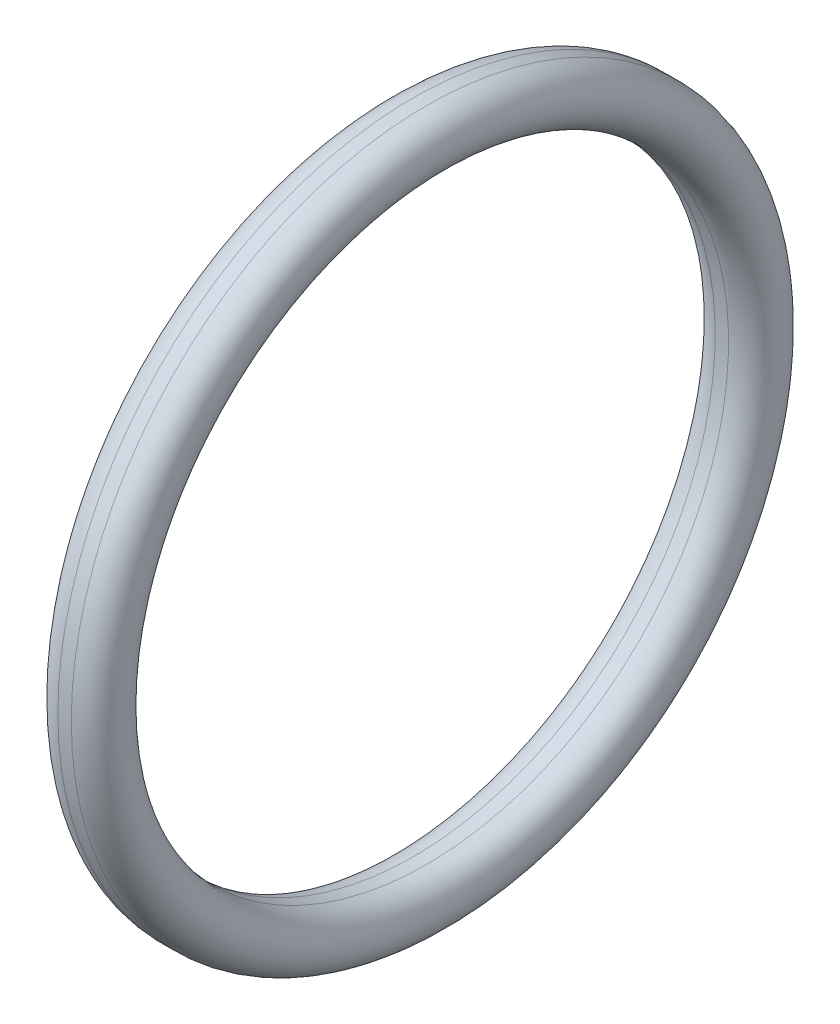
ISO-10303-21;
HEADER;
FILE_DESCRIPTION(('STEP AP214'),'2;1');
FILE_NAME('part.step','',(''),(''),'','','');
FILE_SCHEMA(('AUTOMOTIVE_DESIGN { 1 0 10303 214 1 1 1 1 }'));
ENDSEC;
DATA;
#1=APPLICATION_CONTEXT('core data for automotive mechanical design processes');
#2=APPLICATION_PROTOCOL_DEFINITION('international standard','automotive_design',2000,#1);
#3=PRODUCT_CONTEXT('',#1,'mechanical');
#4=PRODUCT('Part','Part','',(#3));
#5=PRODUCT_RELATED_PRODUCT_CATEGORY('part','',(#4));
#6=PRODUCT_DEFINITION_FORMATION('','',#4);
#7=PRODUCT_DEFINITION_CONTEXT('part definition',#1,'design');
#8=PRODUCT_DEFINITION('design','',#6,#7);
#9=PRODUCT_DEFINITION_SHAPE('','',#8);
#10=(LENGTH_UNIT() NAMED_UNIT(*) SI_UNIT(.MILLI.,.METRE.));
#11=(NAMED_UNIT(*) PLANE_ANGLE_UNIT() SI_UNIT($,.RADIAN.));
#12=(NAMED_UNIT(*) SI_UNIT($,.STERADIAN.) SOLID_ANGLE_UNIT());
#13=UNCERTAINTY_MEASURE_WITH_UNIT(LENGTH_MEASURE(1.E-05),#10,'distance_accuracy_value','');
#14=(GEOMETRIC_REPRESENTATION_CONTEXT(3) GLOBAL_UNCERTAINTY_ASSIGNED_CONTEXT((#13)) GLOBAL_UNIT_ASSIGNED_CONTEXT((#10,
#11,#12)) REPRESENTATION_CONTEXT('',''));
#15=CARTESIAN_POINT('',(0.,0.,0.));
#16=DIRECTION('',(0.,0.,1.));
#17=DIRECTION('',(1.,0.,0.));
#18=AXIS2_PLACEMENT_3D('',#15,#16,#17);
#19=CARTESIAN_POINT('',(-0.254,0.,0.));
#20=DIRECTION('',(-1.,0.,0.));
#21=DIRECTION('',(0.,0.,1.));
#22=AXIS2_PLACEMENT_3D('',#19,#20,#21);
#23=TOROIDAL_SURFACE('',#22,12.4714,1.016);
#24=CARTESIAN_POINT('',(-0.254,0.,0.));
#25=DIRECTION('',(-1.,0.,0.));
#26=DIRECTION('',(0.,0.,1.));
#27=AXIS2_PLACEMENT_3D('',#24,#25,#26);
#28=CIRCLE('',#27,11.4554);
#29=CARTESIAN_POINT('',(-0.254,0.,11.4554));
#30=VERTEX_POINT('',#29);
#31=EDGE_CURVE('E10',#30,#30,#28,.T.);
#32=ORIENTED_EDGE('',*,*,#31,.F.);
#33=EDGE_LOOP('',(#32));
#34=FACE_BOUND('',#33,.T.);
#35=CARTESIAN_POINT('',(-0.254,0.,0.));
#36=DIRECTION('',(-1.,0.,0.));
#37=DIRECTION('',(0.,0.,1.));
#38=AXIS2_PLACEMENT_3D('',#35,#36,#37);
#39=CIRCLE('',#38,13.4874);
#40=CARTESIAN_POINT('',(-0.254,0.,13.4874));
#41=VERTEX_POINT('',#40);
#42=EDGE_CURVE('E392',#41,#41,#39,.T.);
#43=ORIENTED_EDGE('',*,*,#42,.T.);
#44=EDGE_LOOP('',(#43));
#45=FACE_BOUND('',#44,.T.);
#46=ADVANCED_FACE('F378',(#34,#45),#23,.T.);
#47=CARTESIAN_POINT('',(0.,0.,0.));
#48=DIRECTION('',(-1.,0.,0.));
#49=DIRECTION('',(0.,0.,1.));
#50=AXIS2_PLACEMENT_3D('',#47,#48,#49);
#51=CYLINDRICAL_SURFACE('',#50,11.4554);
#52=CARTESIAN_POINT('',(0.254,0.,0.));
#53=DIRECTION('',(-1.,0.,0.));
#54=DIRECTION('',(0.,0.,1.));
#55=AXIS2_PLACEMENT_3D('',#52,#53,#54);
#56=CIRCLE('',#55,11.4554);
#57=CARTESIAN_POINT('',(0.254,0.,11.4554));
#58=VERTEX_POINT('',#57);
#59=EDGE_CURVE('E384',#58,#58,#56,.T.);
#60=ORIENTED_EDGE('',*,*,#59,.F.);
#61=EDGE_LOOP('',(#60));
#62=FACE_BOUND('',#61,.T.);
#63=ORIENTED_EDGE('',*,*,#31,.T.);
#64=EDGE_LOOP('',(#63));
#65=FACE_BOUND('',#64,.T.);
#66=ADVANCED_FACE('F407',(#62,#65),#51,.F.);
#67=CARTESIAN_POINT('',(0.254,0.,0.));
#68=DIRECTION('',(-1.,0.,0.));
#69=DIRECTION('',(0.,0.,1.));
#70=AXIS2_PLACEMENT_3D('',#67,#68,#69);
#71=TOROIDAL_SURFACE('',#70,12.4714,1.016);
#72=CARTESIAN_POINT('',(0.254,0.,0.));
#73=DIRECTION('',(-1.,0.,0.));
#74=DIRECTION('',(0.,0.,1.));
#75=AXIS2_PLACEMENT_3D('',#72,#73,#74);
#76=CIRCLE('',#75,13.4874);
#77=CARTESIAN_POINT('',(0.254,0.,13.4874));
#78=VERTEX_POINT('',#77);
#79=EDGE_CURVE('E388',#78,#78,#76,.T.);
#80=ORIENTED_EDGE('',*,*,#79,.F.);
#81=EDGE_LOOP('',(#80));
#82=FACE_BOUND('',#81,.T.);
#83=ORIENTED_EDGE('',*,*,#59,.T.);
#84=EDGE_LOOP('',(#83));
#85=FACE_BOUND('',#84,.T.);
#86=ADVANCED_FACE('F402',(#82,#85),#71,.T.);
#87=CARTESIAN_POINT('',(0.,0.,0.));
#88=DIRECTION('',(-1.,0.,0.));
#89=DIRECTION('',(0.,0.,1.));
#90=AXIS2_PLACEMENT_3D('',#87,#88,#89);
#91=CYLINDRICAL_SURFACE('',#90,13.4874);
#92=ORIENTED_EDGE('',*,*,#42,.F.);
#93=EDGE_LOOP('',(#92));
#94=FACE_BOUND('',#93,.T.);
#95=ORIENTED_EDGE('',*,*,#79,.T.);
#96=EDGE_LOOP('',(#95));
#97=FACE_BOUND('',#96,.T.);
#98=ADVANCED_FACE('F399',(#94,#97),#91,.T.);
#99=CLOSED_SHELL('',(#46,#66,#86,#98));
#100=MANIFOLD_SOLID_BREP('B2',#99);
#101=ADVANCED_BREP_SHAPE_REPRESENTATION('',(#18,#100),#14);
#102=SHAPE_DEFINITION_REPRESENTATION(#9,#101);
ENDSEC;
END-ISO-10303-21;
